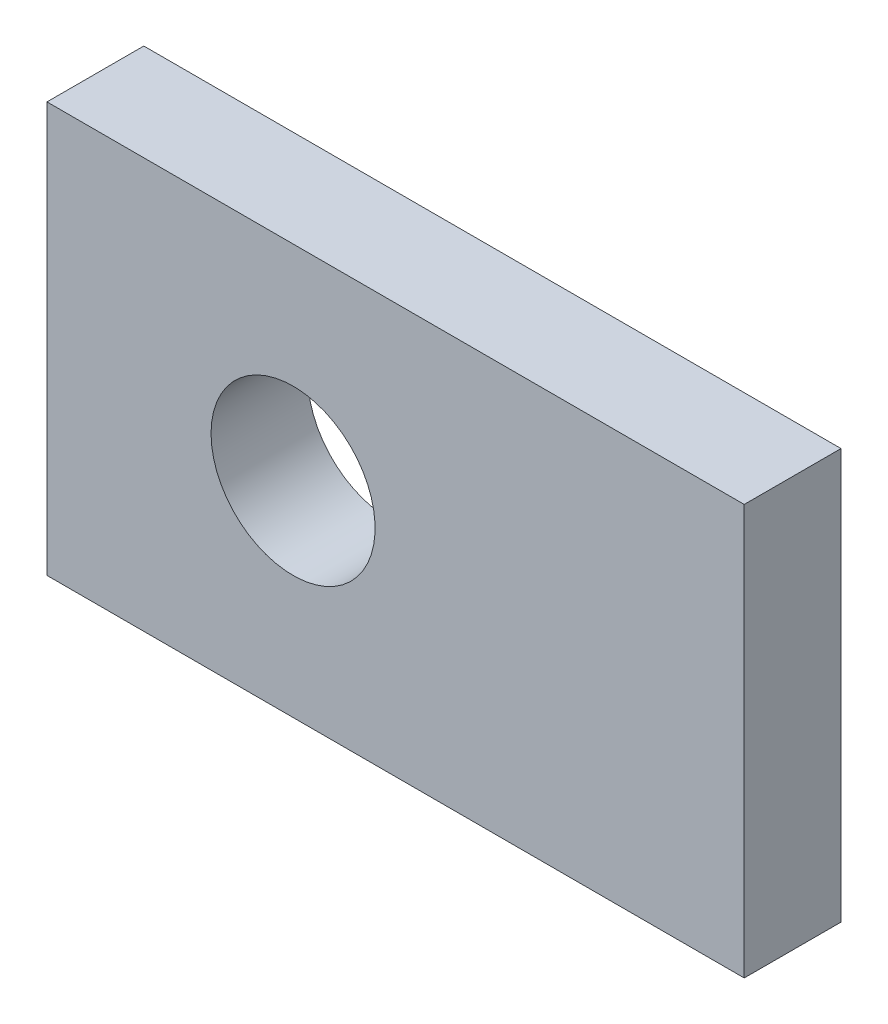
ISO-10303-21;
HEADER;
FILE_DESCRIPTION(('STEP AP214'),'2;1');
FILE_NAME('part.step','',(''),(''),'','','');
FILE_SCHEMA(('AUTOMOTIVE_DESIGN { 1 0 10303 214 1 1 1 1 }'));
ENDSEC;
DATA;
#1=APPLICATION_CONTEXT('core data for automotive mechanical design processes');
#2=APPLICATION_PROTOCOL_DEFINITION('international standard','automotive_design',2000,#1);
#3=PRODUCT_CONTEXT('',#1,'mechanical');
#4=PRODUCT('Part','Part','',(#3));
#5=PRODUCT_RELATED_PRODUCT_CATEGORY('part','',(#4));
#6=PRODUCT_DEFINITION_FORMATION('','',#4);
#7=PRODUCT_DEFINITION_CONTEXT('part definition',#1,'design');
#8=PRODUCT_DEFINITION('design','',#6,#7);
#9=PRODUCT_DEFINITION_SHAPE('','',#8);
#10=(LENGTH_UNIT() NAMED_UNIT(*) SI_UNIT(.MILLI.,.METRE.));
#11=(NAMED_UNIT(*) PLANE_ANGLE_UNIT() SI_UNIT($,.RADIAN.));
#12=(NAMED_UNIT(*) SI_UNIT($,.STERADIAN.) SOLID_ANGLE_UNIT());
#13=UNCERTAINTY_MEASURE_WITH_UNIT(LENGTH_MEASURE(1.E-05),#10,'distance_accuracy_value','');
#14=(GEOMETRIC_REPRESENTATION_CONTEXT(3) GLOBAL_UNCERTAINTY_ASSIGNED_CONTEXT((#13)) GLOBAL_UNIT_ASSIGNED_CONTEXT((#10,
#11,#12)) REPRESENTATION_CONTEXT('',''));
#15=CARTESIAN_POINT('',(0.,0.,0.));
#16=DIRECTION('',(0.,0.,1.));
#17=DIRECTION('',(1.,0.,0.));
#18=AXIS2_PLACEMENT_3D('',#15,#16,#17);
#19=CARTESIAN_POINT('',(0.,0.,2.9972));
#20=DIRECTION('',(0.,0.,-1.));
#21=DIRECTION('',(-1.,0.,0.));
#22=AXIS2_PLACEMENT_3D('',#19,#20,#21);
#23=PLANE('',#22);
#24=DIRECTION('',(0.,-1.,0.));
#25=VECTOR('',#24,1.);
#26=CARTESIAN_POINT('',(0.,0.,2.9972));
#27=LINE('',#26,#25);
#28=CARTESIAN_POINT('',(0.,12.7,2.9972));
#29=VERTEX_POINT('',#28);
#30=CARTESIAN_POINT('',(0.,0.,2.9972));
#31=VERTEX_POINT('',#30);
#32=EDGE_CURVE('E85',#29,#31,#27,.T.);
#33=ORIENTED_EDGE('',*,*,#32,.T.);
#34=DIRECTION('',(1.,0.,0.));
#35=VECTOR('',#34,1.);
#36=CARTESIAN_POINT('',(0.,0.,2.9972));
#37=LINE('',#36,#35);
#38=CARTESIAN_POINT('',(21.59,0.,2.9972));
#39=VERTEX_POINT('',#38);
#40=EDGE_CURVE('E80',#31,#39,#37,.T.);
#41=ORIENTED_EDGE('',*,*,#40,.T.);
#42=DIRECTION('',(0.,1.,0.));
#43=VECTOR('',#42,1.);
#44=CARTESIAN_POINT('',(21.59,0.,2.9972));
#45=LINE('',#44,#43);
#46=CARTESIAN_POINT('',(21.59,12.7,2.9972));
#47=VERTEX_POINT('',#46);
#48=EDGE_CURVE('E83',#39,#47,#45,.T.);
#49=ORIENTED_EDGE('',*,*,#48,.T.);
#50=DIRECTION('',(-1.,0.,0.));
#51=VECTOR('',#50,1.);
#52=CARTESIAN_POINT('',(0.,12.7,2.9972));
#53=LINE('',#52,#51);
#54=EDGE_CURVE('E50',#47,#29,#53,.T.);
#55=ORIENTED_EDGE('',*,*,#54,.T.);
#56=EDGE_LOOP('',(#33,#41,#49,#55));
#57=FACE_BOUND('',#56,.T.);
#58=CARTESIAN_POINT('',(7.62,6.35,2.9972));
#59=DIRECTION('',(0.,0.,1.));
#60=DIRECTION('',(1.,0.,0.));
#61=AXIS2_PLACEMENT_3D('',#58,#59,#60);
#62=CIRCLE('',#61,2.54);
#63=CARTESIAN_POINT('',(5.08,6.35,2.9972));
#64=VERTEX_POINT('',#63);
#65=EDGE_CURVE('E100',#64,#64,#62,.T.);
#66=ORIENTED_EDGE('',*,*,#65,.F.);
#67=EDGE_LOOP('',(#66));
#68=FACE_BOUND('',#67,.T.);
#69=ADVANCED_FACE('F33',(#57,#68),#23,.F.);
#70=CARTESIAN_POINT('',(0.,0.,0.));
#71=DIRECTION('',(0.,0.,-1.));
#72=DIRECTION('',(-1.,0.,0.));
#73=AXIS2_PLACEMENT_3D('',#70,#71,#72);
#74=PLANE('',#73);
#75=DIRECTION('',(0.,-1.,0.));
#76=VECTOR('',#75,1.);
#77=CARTESIAN_POINT('',(0.,0.,0.));
#78=LINE('',#77,#76);
#79=CARTESIAN_POINT('',(0.,12.7,0.));
#80=VERTEX_POINT('',#79);
#81=CARTESIAN_POINT('',(0.,0.,0.));
#82=VERTEX_POINT('',#81);
#83=EDGE_CURVE('E97',#80,#82,#78,.T.);
#84=ORIENTED_EDGE('',*,*,#83,.F.);
#85=DIRECTION('',(-1.,0.,0.));
#86=VECTOR('',#85,1.);
#87=CARTESIAN_POINT('',(0.,12.7,0.));
#88=LINE('',#87,#86);
#89=CARTESIAN_POINT('',(21.59,12.7,0.));
#90=VERTEX_POINT('',#89);
#91=EDGE_CURVE('E73',#90,#80,#88,.T.);
#92=ORIENTED_EDGE('',*,*,#91,.F.);
#93=DIRECTION('',(0.,1.,0.));
#94=VECTOR('',#93,1.);
#95=CARTESIAN_POINT('',(21.59,0.,0.));
#96=LINE('',#95,#94);
#97=CARTESIAN_POINT('',(21.59,0.,0.));
#98=VERTEX_POINT('',#97);
#99=EDGE_CURVE('E67',#98,#90,#96,.T.);
#100=ORIENTED_EDGE('',*,*,#99,.F.);
#101=DIRECTION('',(1.,0.,0.));
#102=VECTOR('',#101,1.);
#103=CARTESIAN_POINT('',(0.,0.,0.));
#104=LINE('',#103,#102);
#105=EDGE_CURVE('E89',#82,#98,#104,.T.);
#106=ORIENTED_EDGE('',*,*,#105,.F.);
#107=EDGE_LOOP('',(#84,#92,#100,#106));
#108=FACE_BOUND('',#107,.T.);
#109=CARTESIAN_POINT('',(7.62,6.35,0.));
#110=DIRECTION('',(0.,0.,1.));
#111=DIRECTION('',(1.,0.,0.));
#112=AXIS2_PLACEMENT_3D('',#109,#110,#111);
#113=CIRCLE('',#112,2.54);
#114=CARTESIAN_POINT('',(5.08,6.35,0.));
#115=VERTEX_POINT('',#114);
#116=EDGE_CURVE('E112',#115,#115,#113,.T.);
#117=ORIENTED_EDGE('',*,*,#116,.T.);
#118=EDGE_LOOP('',(#117));
#119=FACE_BOUND('',#118,.T.);
#120=ADVANCED_FACE('F108',(#108,#119),#74,.T.);
#121=CARTESIAN_POINT('',(0.,0.,2.9972));
#122=DIRECTION('',(1.,0.,0.));
#123=DIRECTION('',(0.,0.,-1.));
#124=AXIS2_PLACEMENT_3D('',#121,#122,#123);
#125=PLANE('',#124);
#126=ORIENTED_EDGE('',*,*,#83,.T.);
#127=DIRECTION('',(0.,0.,-1.));
#128=VECTOR('',#127,1.);
#129=CARTESIAN_POINT('',(0.,0.,2.9972));
#130=LINE('',#129,#128);
#131=EDGE_CURVE('E11',#31,#82,#130,.T.);
#132=ORIENTED_EDGE('',*,*,#131,.F.);
#133=ORIENTED_EDGE('',*,*,#32,.F.);
#134=DIRECTION('',(0.,0.,-1.));
#135=VECTOR('',#134,1.);
#136=CARTESIAN_POINT('',(0.,12.7,2.9972));
#137=LINE('',#136,#135);
#138=EDGE_CURVE('E93',#29,#80,#137,.T.);
#139=ORIENTED_EDGE('',*,*,#138,.T.);
#140=EDGE_LOOP('',(#126,#132,#133,#139));
#141=FACE_BOUND('',#140,.T.);
#142=ADVANCED_FACE('F35',(#141),#125,.F.);
#143=CARTESIAN_POINT('',(0.,0.,2.9972));
#144=DIRECTION('',(0.,1.,0.));
#145=DIRECTION('',(0.,0.,1.));
#146=AXIS2_PLACEMENT_3D('',#143,#144,#145);
#147=PLANE('',#146);
#148=ORIENTED_EDGE('',*,*,#105,.T.);
#149=DIRECTION('',(0.,0.,-1.));
#150=VECTOR('',#149,1.);
#151=CARTESIAN_POINT('',(21.59,0.,2.9972));
#152=LINE('',#151,#150);
#153=EDGE_CURVE('E42',#39,#98,#152,.T.);
#154=ORIENTED_EDGE('',*,*,#153,.F.);
#155=ORIENTED_EDGE('',*,*,#40,.F.);
#156=ORIENTED_EDGE('',*,*,#131,.T.);
#157=EDGE_LOOP('',(#148,#154,#155,#156));
#158=FACE_BOUND('',#157,.T.);
#159=ADVANCED_FACE('F88',(#158),#147,.F.);
#160=CARTESIAN_POINT('',(21.59,0.,2.9972));
#161=DIRECTION('',(-1.,0.,0.));
#162=DIRECTION('',(0.,0.,1.));
#163=AXIS2_PLACEMENT_3D('',#160,#161,#162);
#164=PLANE('',#163);
#165=ORIENTED_EDGE('',*,*,#99,.T.);
#166=DIRECTION('',(0.,0.,-1.));
#167=VECTOR('',#166,1.);
#168=CARTESIAN_POINT('',(21.59,12.7,2.9972));
#169=LINE('',#168,#167);
#170=EDGE_CURVE('E90',#47,#90,#169,.T.);
#171=ORIENTED_EDGE('',*,*,#170,.F.);
#172=ORIENTED_EDGE('',*,*,#48,.F.);
#173=ORIENTED_EDGE('',*,*,#153,.T.);
#174=EDGE_LOOP('',(#165,#171,#172,#173));
#175=FACE_BOUND('',#174,.T.);
#176=ADVANCED_FACE('F91',(#175),#164,.F.);
#177=CARTESIAN_POINT('',(0.,12.7,2.9972));
#178=DIRECTION('',(0.,-1.,0.));
#179=DIRECTION('',(0.,0.,-1.));
#180=AXIS2_PLACEMENT_3D('',#177,#178,#179);
#181=PLANE('',#180);
#182=ORIENTED_EDGE('',*,*,#91,.T.);
#183=ORIENTED_EDGE('',*,*,#138,.F.);
#184=ORIENTED_EDGE('',*,*,#54,.F.);
#185=ORIENTED_EDGE('',*,*,#170,.T.);
#186=EDGE_LOOP('',(#182,#183,#184,#185));
#187=FACE_BOUND('',#186,.T.);
#188=ADVANCED_FACE('F105',(#187),#181,.F.);
#189=CARTESIAN_POINT('',(7.62,6.35,2.9972));
#190=DIRECTION('',(0.,0.,-1.));
#191=DIRECTION('',(-1.,0.,0.));
#192=AXIS2_PLACEMENT_3D('',#189,#190,#191);
#193=CYLINDRICAL_SURFACE('',#192,2.54);
#194=CARTESIAN_POINT('',(5.08,6.35,2.9972));
#195=CARTESIAN_POINT('',(5.08,6.35,2.96597916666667));
#196=CARTESIAN_POINT('',(5.08,6.35,2.93475833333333));
#197=CARTESIAN_POINT('',(5.08,6.35,2.87231666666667));
#198=CARTESIAN_POINT('',(5.08,6.35,2.84109583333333));
#199=CARTESIAN_POINT('',(5.08,6.35,2.77865416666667));
#200=CARTESIAN_POINT('',(5.08,6.35,2.74743333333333));
#201=CARTESIAN_POINT('',(5.08,6.35,2.68499166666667));
#202=CARTESIAN_POINT('',(5.08,6.35,2.65377083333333));
#203=CARTESIAN_POINT('',(5.08,6.35,2.59132916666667));
#204=CARTESIAN_POINT('',(5.08,6.35,2.56010833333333));
#205=CARTESIAN_POINT('',(5.08,6.35,2.49766666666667));
#206=CARTESIAN_POINT('',(5.08,6.35,2.46644583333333));
#207=CARTESIAN_POINT('',(5.08,6.35,2.40400416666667));
#208=CARTESIAN_POINT('',(5.08,6.35,2.37278333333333));
#209=CARTESIAN_POINT('',(5.08,6.35,2.31034166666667));
#210=CARTESIAN_POINT('',(5.08,6.35,2.27912083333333));
#211=CARTESIAN_POINT('',(5.08,6.35,2.21667916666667));
#212=CARTESIAN_POINT('',(5.08,6.35,2.18545833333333));
#213=CARTESIAN_POINT('',(5.08,6.35,2.12301666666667));
#214=CARTESIAN_POINT('',(5.08,6.35,2.09179583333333));
#215=CARTESIAN_POINT('',(5.08,6.35,2.02935416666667));
#216=CARTESIAN_POINT('',(5.08,6.35,1.99813333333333));
#217=CARTESIAN_POINT('',(5.08,6.35,1.93569166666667));
#218=CARTESIAN_POINT('',(5.08,6.35,1.90447083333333));
#219=CARTESIAN_POINT('',(5.08,6.35,1.84202916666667));
#220=CARTESIAN_POINT('',(5.08,6.35,1.81080833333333));
#221=CARTESIAN_POINT('',(5.08,6.35,1.74836666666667));
#222=CARTESIAN_POINT('',(5.08,6.35,1.71714583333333));
#223=CARTESIAN_POINT('',(5.08,6.35,1.65470416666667));
#224=CARTESIAN_POINT('',(5.08,6.35,1.62348333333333));
#225=CARTESIAN_POINT('',(5.08,6.35,1.56104166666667));
#226=CARTESIAN_POINT('',(5.08,6.35,1.52982083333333));
#227=CARTESIAN_POINT('',(5.08,6.35,1.46737916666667));
#228=CARTESIAN_POINT('',(5.08,6.35,1.43615833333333));
#229=CARTESIAN_POINT('',(5.08,6.35,1.37371666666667));
#230=CARTESIAN_POINT('',(5.08,6.35,1.34249583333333));
#231=CARTESIAN_POINT('',(5.08,6.35,1.28005416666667));
#232=CARTESIAN_POINT('',(5.08,6.35,1.24883333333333));
#233=CARTESIAN_POINT('',(5.08,6.35,1.18639166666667));
#234=CARTESIAN_POINT('',(5.08,6.35,1.15517083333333));
#235=CARTESIAN_POINT('',(5.08,6.35,1.09272916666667));
#236=CARTESIAN_POINT('',(5.08,6.35,1.06150833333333));
#237=CARTESIAN_POINT('',(5.08,6.35,0.999066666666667));
#238=CARTESIAN_POINT('',(5.08,6.35,0.967845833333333));
#239=CARTESIAN_POINT('',(5.08,6.35,0.905404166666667));
#240=CARTESIAN_POINT('',(5.08,6.35,0.874183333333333));
#241=CARTESIAN_POINT('',(5.08,6.35,0.811741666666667));
#242=CARTESIAN_POINT('',(5.08,6.35,0.780520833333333));
#243=CARTESIAN_POINT('',(5.08,6.35,0.718079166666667));
#244=CARTESIAN_POINT('',(5.08,6.35,0.686858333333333));
#245=CARTESIAN_POINT('',(5.08,6.35,0.624416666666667));
#246=CARTESIAN_POINT('',(5.08,6.35,0.593195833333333));
#247=CARTESIAN_POINT('',(5.08,6.35,0.530754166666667));
#248=CARTESIAN_POINT('',(5.08,6.35,0.499533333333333));
#249=CARTESIAN_POINT('',(5.08,6.35,0.437091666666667));
#250=CARTESIAN_POINT('',(5.08,6.35,0.405870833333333));
#251=CARTESIAN_POINT('',(5.08,6.35,0.343429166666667));
#252=CARTESIAN_POINT('',(5.08,6.35,0.312208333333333));
#253=CARTESIAN_POINT('',(5.08,6.35,0.249766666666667));
#254=CARTESIAN_POINT('',(5.08,6.35,0.218545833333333));
#255=CARTESIAN_POINT('',(5.08,6.35,0.156104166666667));
#256=CARTESIAN_POINT('',(5.08,6.35,0.124883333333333));
#257=CARTESIAN_POINT('',(5.08,6.35,0.0624416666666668));
#258=CARTESIAN_POINT('',(5.08,6.35,0.0312208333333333));
#259=CARTESIAN_POINT('',(5.08,6.35,0.));
#260=B_SPLINE_CURVE_WITH_KNOTS('',3,(#194,#195,#196,#197,#198,#199,#200,#201,#202,#203,#204,
#205,#206,#207,#208,#209,#210,#211,#212,#213,#214,#215,#216,#217,#218,#219,#220,#221,#222,#223,
#224,#225,#226,#227,#228,#229,#230,#231,#232,#233,#234,#235,#236,#237,#238,#239,#240,#241,#242,
#243,#244,#245,#246,#247,#248,#249,#250,#251,#252,#253,#254,#255,#256,#257,#258,#259),
.UNSPECIFIED.,.F.,.F.,(4,2,2,2,2,2,2,2,2,2,2,2,2,2,2,2,2,2,2,2,2,2,2,2,2,2,2,2,2,2,2,2,4),(0.,
0.0936625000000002,0.187325,0.2809875,0.37465,0.4683125,0.561975,0.6556375,0.7493,0.8429625,
0.936625,1.0302875,1.12395,1.2176125,1.311275,1.4049375,1.4986,1.5922625,1.685925,1.7795875,
1.87325,1.9669125,2.060575,2.1542375,2.2479,2.3415625,2.435225,2.5288875,2.62255,2.7162125,
2.809875,2.9035375,2.9972),.UNSPECIFIED.);
#261=EDGE_CURVE('BSEAM118',#64,#115,#260,.T.);
#262=ORIENTED_EDGE('',*,*,#65,.T.);
#263=ORIENTED_EDGE('',*,*,#116,.F.);
#264=ORIENTED_EDGE('',*,*,#261,.T.);
#265=ORIENTED_EDGE('',*,*,#261,.F.);
#266=EDGE_LOOP('',(#262,#264,#263,#265));
#267=FACE_BOUND('',#266,.T.);
#268=ADVANCED_FACE('F118',(#267),#193,.F.);
#269=CLOSED_SHELL('',(#69,#120,#142,#159,#176,#188,#268));
#270=MANIFOLD_SOLID_BREP('B2',#269);
#271=ADVANCED_BREP_SHAPE_REPRESENTATION('',(#18,#270),#14);
#272=SHAPE_DEFINITION_REPRESENTATION(#9,#271);
ENDSEC;
END-ISO-10303-21;
